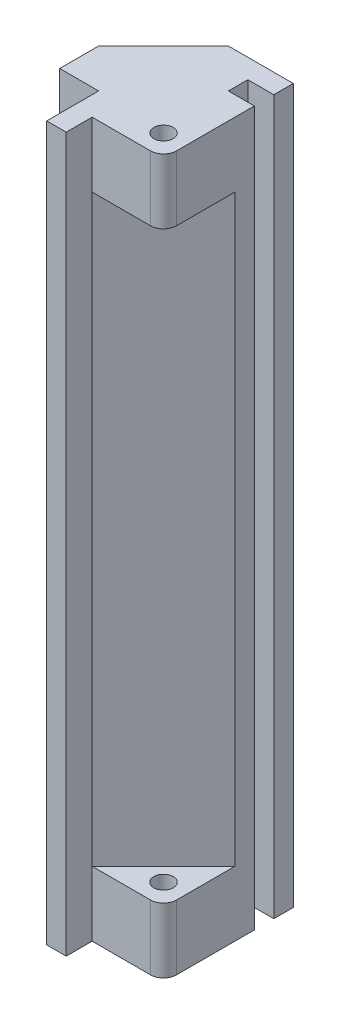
ISO-10303-21;
HEADER;
FILE_DESCRIPTION(('STEP AP214'),'2;1');
FILE_NAME('part.step','',(''),(''),'','','');
FILE_SCHEMA(('AUTOMOTIVE_DESIGN { 1 0 10303 214 1 1 1 1 }'));
ENDSEC;
DATA;
#1=APPLICATION_CONTEXT('core data for automotive mechanical design processes');
#2=APPLICATION_PROTOCOL_DEFINITION('international standard','automotive_design',2000,#1);
#3=PRODUCT_CONTEXT('',#1,'mechanical');
#4=PRODUCT('Part','Part','',(#3));
#5=PRODUCT_RELATED_PRODUCT_CATEGORY('part','',(#4));
#6=PRODUCT_DEFINITION_FORMATION('','',#4);
#7=PRODUCT_DEFINITION_CONTEXT('part definition',#1,'design');
#8=PRODUCT_DEFINITION('design','',#6,#7);
#9=PRODUCT_DEFINITION_SHAPE('','',#8);
#10=(LENGTH_UNIT() NAMED_UNIT(*) SI_UNIT(.MILLI.,.METRE.));
#11=(NAMED_UNIT(*) PLANE_ANGLE_UNIT() SI_UNIT($,.RADIAN.));
#12=(NAMED_UNIT(*) SI_UNIT($,.STERADIAN.) SOLID_ANGLE_UNIT());
#13=UNCERTAINTY_MEASURE_WITH_UNIT(LENGTH_MEASURE(1.E-05),#10,'distance_accuracy_value','');
#14=(GEOMETRIC_REPRESENTATION_CONTEXT(3) GLOBAL_UNCERTAINTY_ASSIGNED_CONTEXT((#13)) GLOBAL_UNIT_ASSIGNED_CONTEXT((#10,
#11,#12)) REPRESENTATION_CONTEXT('',''));
#15=CARTESIAN_POINT('',(0.,0.,0.));
#16=DIRECTION('',(0.,0.,1.));
#17=DIRECTION('',(1.,0.,0.));
#18=AXIS2_PLACEMENT_3D('',#15,#16,#17);
#19=CARTESIAN_POINT('',(15.,110.,-17.));
#20=DIRECTION('',(0.,0.,-1.));
#21=DIRECTION('',(-1.,0.,0.));
#22=AXIS2_PLACEMENT_3D('',#19,#20,#21);
#23=PLANE('',#22);
#24=DIRECTION('',(1.,0.,0.));
#25=VECTOR('',#24,1.);
#26=CARTESIAN_POINT('',(15.,0.,-17.));
#27=LINE('',#26,#25);
#28=CARTESIAN_POINT('',(11.,0.,-17.));
#29=VERTEX_POINT('',#28);
#30=CARTESIAN_POINT('',(15.,0.,-17.));
#31=VERTEX_POINT('',#30);
#32=EDGE_CURVE('E227',#29,#31,#27,.T.);
#33=ORIENTED_EDGE('',*,*,#32,.T.);
#34=DIRECTION('',(0.,-1.,0.));
#35=VECTOR('',#34,1.);
#36=CARTESIAN_POINT('',(15.,110.,-17.));
#37=LINE('',#36,#35);
#38=CARTESIAN_POINT('',(15.,110.,-17.));
#39=VERTEX_POINT('',#38);
#40=EDGE_CURVE('E292',#39,#31,#37,.T.);
#41=ORIENTED_EDGE('',*,*,#40,.F.);
#42=DIRECTION('',(1.,0.,0.));
#43=VECTOR('',#42,1.);
#44=CARTESIAN_POINT('',(15.,110.,-17.));
#45=LINE('',#44,#43);
#46=CARTESIAN_POINT('',(11.,110.,-17.));
#47=VERTEX_POINT('',#46);
#48=EDGE_CURVE('E228',#47,#39,#45,.T.);
#49=ORIENTED_EDGE('',*,*,#48,.F.);
#50=DIRECTION('',(0.,-1.,0.));
#51=VECTOR('',#50,1.);
#52=CARTESIAN_POINT('',(11.,110.,-17.));
#53=LINE('',#52,#51);
#54=EDGE_CURVE('E251',#47,#29,#53,.T.);
#55=ORIENTED_EDGE('',*,*,#54,.T.);
#56=EDGE_LOOP('',(#33,#41,#49,#55));
#57=FACE_BOUND('',#56,.T.);
#58=ADVANCED_FACE('F33',(#57),#23,.F.);
#59=CARTESIAN_POINT('',(15.,110.,-20.));
#60=DIRECTION('',(-1.,0.,0.));
#61=DIRECTION('',(0.,0.,1.));
#62=AXIS2_PLACEMENT_3D('',#59,#60,#61);
#63=PLANE('',#62);
#64=DIRECTION('',(0.,0.,-1.));
#65=VECTOR('',#64,1.);
#66=CARTESIAN_POINT('',(15.,0.,-20.));
#67=LINE('',#66,#65);
#68=CARTESIAN_POINT('',(15.,0.,-20.));
#69=VERTEX_POINT('',#68);
#70=EDGE_CURVE('E254',#31,#69,#67,.T.);
#71=ORIENTED_EDGE('',*,*,#70,.T.);
#72=DIRECTION('',(0.,-1.,0.));
#73=VECTOR('',#72,1.);
#74=CARTESIAN_POINT('',(15.,110.,-20.));
#75=LINE('',#74,#73);
#76=CARTESIAN_POINT('',(15.,110.,-20.));
#77=VERTEX_POINT('',#76);
#78=EDGE_CURVE('E289',#77,#69,#75,.T.);
#79=ORIENTED_EDGE('',*,*,#78,.F.);
#80=DIRECTION('',(0.,0.,-1.));
#81=VECTOR('',#80,1.);
#82=CARTESIAN_POINT('',(15.,110.,-20.));
#83=LINE('',#82,#81);
#84=EDGE_CURVE('E231',#39,#77,#83,.T.);
#85=ORIENTED_EDGE('',*,*,#84,.F.);
#86=ORIENTED_EDGE('',*,*,#40,.T.);
#87=EDGE_LOOP('',(#71,#79,#85,#86));
#88=FACE_BOUND('',#87,.T.);
#89=ADVANCED_FACE('F323',(#88),#63,.F.);
#90=CARTESIAN_POINT('',(5.,110.,-20.));
#91=DIRECTION('',(0.,0.,1.));
#92=DIRECTION('',(1.,0.,0.));
#93=AXIS2_PLACEMENT_3D('',#90,#91,#92);
#94=PLANE('',#93);
#95=DIRECTION('',(-1.,0.,0.));
#96=VECTOR('',#95,1.);
#97=CARTESIAN_POINT('',(5.,0.,-20.));
#98=LINE('',#97,#96);
#99=CARTESIAN_POINT('',(5.,0.,-20.));
#100=VERTEX_POINT('',#99);
#101=EDGE_CURVE('E256',#69,#100,#98,.T.);
#102=ORIENTED_EDGE('',*,*,#101,.T.);
#103=DIRECTION('',(0.,-1.,0.));
#104=VECTOR('',#103,1.);
#105=CARTESIAN_POINT('',(5.,110.,-20.));
#106=LINE('',#105,#104);
#107=CARTESIAN_POINT('',(5.,110.,-20.));
#108=VERTEX_POINT('',#107);
#109=EDGE_CURVE('E286',#108,#100,#106,.T.);
#110=ORIENTED_EDGE('',*,*,#109,.F.);
#111=DIRECTION('',(-1.,0.,0.));
#112=VECTOR('',#111,1.);
#113=CARTESIAN_POINT('',(5.,110.,-20.));
#114=LINE('',#113,#112);
#115=EDGE_CURVE('E234',#77,#108,#114,.T.);
#116=ORIENTED_EDGE('',*,*,#115,.F.);
#117=ORIENTED_EDGE('',*,*,#78,.T.);
#118=EDGE_LOOP('',(#102,#110,#116,#117));
#119=FACE_BOUND('',#118,.T.);
#120=ADVANCED_FACE('F329',(#119),#94,.F.);
#121=CARTESIAN_POINT('',(-5.,110.,-10.));
#122=DIRECTION('',(0.707106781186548,0.,0.707106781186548));
#123=DIRECTION('',(0.707106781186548,0.,-0.707106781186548));
#124=AXIS2_PLACEMENT_3D('',#121,#122,#123);
#125=PLANE('',#124);
#126=DIRECTION('',(-0.707106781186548,0.,0.707106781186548));
#127=VECTOR('',#126,1.);
#128=CARTESIAN_POINT('',(-5.,0.,-10.));
#129=LINE('',#128,#127);
#130=CARTESIAN_POINT('',(-5.,0.,-10.));
#131=VERTEX_POINT('',#130);
#132=EDGE_CURVE('E258',#100,#131,#129,.T.);
#133=ORIENTED_EDGE('',*,*,#132,.T.);
#134=DIRECTION('',(0.,-1.,0.));
#135=VECTOR('',#134,1.);
#136=CARTESIAN_POINT('',(-5.,110.,-10.));
#137=LINE('',#136,#135);
#138=CARTESIAN_POINT('',(-5.,110.,-10.));
#139=VERTEX_POINT('',#138);
#140=EDGE_CURVE('E283',#139,#131,#137,.T.);
#141=ORIENTED_EDGE('',*,*,#140,.F.);
#142=DIRECTION('',(-0.707106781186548,0.,0.707106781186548));
#143=VECTOR('',#142,1.);
#144=CARTESIAN_POINT('',(-5.,110.,-10.));
#145=LINE('',#144,#143);
#146=EDGE_CURVE('E236',#108,#139,#145,.T.);
#147=ORIENTED_EDGE('',*,*,#146,.F.);
#148=ORIENTED_EDGE('',*,*,#109,.T.);
#149=EDGE_LOOP('',(#133,#141,#147,#148));
#150=FACE_BOUND('',#149,.T.);
#151=ADVANCED_FACE('F335',(#150),#125,.F.);
#152=CARTESIAN_POINT('',(-5.,110.,-10.));
#153=DIRECTION('',(1.,0.,0.));
#154=DIRECTION('',(0.,0.,-1.));
#155=AXIS2_PLACEMENT_3D('',#152,#153,#154);
#156=PLANE('',#155);
#157=DIRECTION('',(0.,0.,1.));
#158=VECTOR('',#157,1.);
#159=CARTESIAN_POINT('',(-5.,0.,-10.));
#160=LINE('',#159,#158);
#161=CARTESIAN_POINT('',(-5.,0.,-4.));
#162=VERTEX_POINT('',#161);
#163=EDGE_CURVE('E260',#131,#162,#160,.T.);
#164=ORIENTED_EDGE('',*,*,#163,.T.);
#165=DIRECTION('',(0.,1.,0.));
#166=VECTOR('',#165,1.);
#167=CARTESIAN_POINT('',(-5.,110.,-4.));
#168=LINE('',#167,#166);
#169=CARTESIAN_POINT('',(-5.,110.,-4.));
#170=VERTEX_POINT('',#169);
#171=EDGE_CURVE('E224',#162,#170,#168,.T.);
#172=ORIENTED_EDGE('',*,*,#171,.T.);
#173=DIRECTION('',(0.,0.,1.));
#174=VECTOR('',#173,1.);
#175=CARTESIAN_POINT('',(-5.,110.,-10.));
#176=LINE('',#175,#174);
#177=EDGE_CURVE('E238',#139,#170,#176,.T.);
#178=ORIENTED_EDGE('',*,*,#177,.F.);
#179=ORIENTED_EDGE('',*,*,#140,.T.);
#180=EDGE_LOOP('',(#164,#172,#178,#179));
#181=FACE_BOUND('',#180,.T.);
#182=ADVANCED_FACE('F339',(#181),#156,.F.);
#183=CARTESIAN_POINT('',(-2.,110.,-4.));
#184=DIRECTION('',(0.,0.,-1.));
#185=DIRECTION('',(-1.,0.,0.));
#186=AXIS2_PLACEMENT_3D('',#183,#184,#185);
#187=PLANE('',#186);
#188=DIRECTION('',(1.,0.,0.));
#189=VECTOR('',#188,1.);
#190=CARTESIAN_POINT('',(-2.,0.,-4.));
#191=LINE('',#190,#189);
#192=CARTESIAN_POINT('',(1.,0.,-4.));
#193=VERTEX_POINT('',#192);
#194=EDGE_CURVE('E263',#162,#193,#191,.T.);
#195=ORIENTED_EDGE('',*,*,#194,.T.);
#196=DIRECTION('',(0.,-1.,0.));
#197=VECTOR('',#196,1.);
#198=CARTESIAN_POINT('',(1.,110.,-4.));
#199=LINE('',#198,#197);
#200=CARTESIAN_POINT('',(1.,110.,-4.));
#201=VERTEX_POINT('',#200);
#202=EDGE_CURVE('E184',#201,#193,#199,.T.);
#203=ORIENTED_EDGE('',*,*,#202,.F.);
#204=DIRECTION('',(1.,0.,0.));
#205=VECTOR('',#204,1.);
#206=CARTESIAN_POINT('',(-2.,110.,-4.));
#207=LINE('',#206,#205);
#208=EDGE_CURVE('E241',#170,#201,#207,.T.);
#209=ORIENTED_EDGE('',*,*,#208,.F.);
#210=ORIENTED_EDGE('',*,*,#171,.F.);
#211=EDGE_LOOP('',(#195,#203,#209,#210));
#212=FACE_BOUND('',#211,.T.);
#213=ADVANCED_FACE('F343',(#212),#187,.F.);
#214=CARTESIAN_POINT('',(1.,110.,-4.));
#215=DIRECTION('',(1.,0.,0.));
#216=DIRECTION('',(0.,0.,-1.));
#217=AXIS2_PLACEMENT_3D('',#214,#215,#216);
#218=PLANE('',#217);
#219=DIRECTION('',(0.,0.,1.));
#220=VECTOR('',#219,1.);
#221=CARTESIAN_POINT('',(1.,0.,-4.));
#222=LINE('',#221,#220);
#223=CARTESIAN_POINT('',(1.,0.,4.));
#224=VERTEX_POINT('',#223);
#225=EDGE_CURVE('E265',#193,#224,#222,.T.);
#226=ORIENTED_EDGE('',*,*,#225,.T.);
#227=DIRECTION('',(0.,-1.,0.));
#228=VECTOR('',#227,1.);
#229=CARTESIAN_POINT('',(1.,110.,4.));
#230=LINE('',#229,#228);
#231=CARTESIAN_POINT('',(1.,110.,4.));
#232=VERTEX_POINT('',#231);
#233=EDGE_CURVE('E217',#232,#224,#230,.T.);
#234=ORIENTED_EDGE('',*,*,#233,.F.);
#235=DIRECTION('',(0.,0.,1.));
#236=VECTOR('',#235,1.);
#237=CARTESIAN_POINT('',(1.,110.,-4.));
#238=LINE('',#237,#236);
#239=EDGE_CURVE('E243',#201,#232,#238,.T.);
#240=ORIENTED_EDGE('',*,*,#239,.F.);
#241=ORIENTED_EDGE('',*,*,#202,.T.);
#242=EDGE_LOOP('',(#226,#234,#240,#241));
#243=FACE_BOUND('',#242,.T.);
#244=ADVANCED_FACE('F347',(#243),#218,.F.);
#245=CARTESIAN_POINT('',(15.,110.,-11.));
#246=DIRECTION('',(-0.707106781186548,0.,-0.707106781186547));
#247=DIRECTION('',(-0.707106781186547,0.,0.707106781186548));
#248=AXIS2_PLACEMENT_3D('',#245,#246,#247);
#249=PLANE('',#248);
#250=DIRECTION('',(0.,-1.,0.));
#251=VECTOR('',#250,1.);
#252=CARTESIAN_POINT('',(15.,110.,-11.));
#253=LINE('',#252,#251);
#254=CARTESIAN_POINT('',(15.,100.,-11.));
#255=VERTEX_POINT('',#254);
#256=CARTESIAN_POINT('',(15.,9.99999999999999,-11.));
#257=VERTEX_POINT('',#256);
#258=EDGE_CURVE('E171',#255,#257,#253,.T.);
#259=ORIENTED_EDGE('',*,*,#258,.F.);
#260=DIRECTION('',(-0.707106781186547,0.,0.707106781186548));
#261=VECTOR('',#260,1.);
#262=CARTESIAN_POINT('',(4.,100.,0.));
#263=LINE('',#262,#261);
#264=CARTESIAN_POINT('',(4.,100.,0.));
#265=VERTEX_POINT('',#264);
#266=EDGE_CURVE('E175',#255,#265,#263,.T.);
#267=ORIENTED_EDGE('',*,*,#266,.T.);
#268=DIRECTION('',(0.,-1.,0.));
#269=VECTOR('',#268,1.);
#270=CARTESIAN_POINT('',(4.,110.,0.));
#271=LINE('',#270,#269);
#272=CARTESIAN_POINT('',(4.,9.99999999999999,0.));
#273=VERTEX_POINT('',#272);
#274=EDGE_CURVE('E158',#265,#273,#271,.T.);
#275=ORIENTED_EDGE('',*,*,#274,.T.);
#276=DIRECTION('',(0.707106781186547,0.,-0.707106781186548));
#277=VECTOR('',#276,1.);
#278=CARTESIAN_POINT('',(15.,10.,-11.));
#279=LINE('',#278,#277);
#280=EDGE_CURVE('E200',#273,#257,#279,.T.);
#281=ORIENTED_EDGE('',*,*,#280,.T.);
#282=EDGE_LOOP('',(#259,#267,#275,#281));
#283=FACE_BOUND('',#282,.T.);
#284=ADVANCED_FACE('F176',(#283),#249,.F.);
#285=CARTESIAN_POINT('',(15.,110.,-14.));
#286=DIRECTION('',(-1.,0.,0.));
#287=DIRECTION('',(0.,0.,1.));
#288=AXIS2_PLACEMENT_3D('',#285,#286,#287);
#289=PLANE('',#288);
#290=DIRECTION('',(0.,0.,1.));
#291=VECTOR('',#290,1.);
#292=CARTESIAN_POINT('',(15.,10.,0.));
#293=LINE('',#292,#291);
#294=CARTESIAN_POINT('',(15.,10.,-2.));
#295=VERTEX_POINT('',#294);
#296=EDGE_CURVE('E202',#257,#295,#293,.T.);
#297=ORIENTED_EDGE('',*,*,#296,.T.);
#298=DIRECTION('',(0.,-1.,0.));
#299=VECTOR('',#298,1.);
#300=CARTESIAN_POINT('',(15.,0.,-2.));
#301=LINE('',#300,#299);
#302=CARTESIAN_POINT('',(15.,0.,-2.));
#303=VERTEX_POINT('',#302);
#304=EDGE_CURVE('E297',#295,#303,#301,.T.);
#305=ORIENTED_EDGE('',*,*,#304,.T.);
#306=DIRECTION('',(0.,0.,-1.));
#307=VECTOR('',#306,1.);
#308=CARTESIAN_POINT('',(15.,0.,-14.));
#309=LINE('',#308,#307);
#310=CARTESIAN_POINT('',(15.,0.,-14.));
#311=VERTEX_POINT('',#310);
#312=EDGE_CURVE('E267',#303,#311,#309,.T.);
#313=ORIENTED_EDGE('',*,*,#312,.T.);
#314=DIRECTION('',(0.,-1.,0.));
#315=VECTOR('',#314,1.);
#316=CARTESIAN_POINT('',(15.,110.,-14.));
#317=LINE('',#316,#315);
#318=CARTESIAN_POINT('',(15.,110.,-14.));
#319=VERTEX_POINT('',#318);
#320=EDGE_CURVE('E277',#319,#311,#317,.T.);
#321=ORIENTED_EDGE('',*,*,#320,.F.);
#322=DIRECTION('',(0.,0.,-1.));
#323=VECTOR('',#322,1.);
#324=CARTESIAN_POINT('',(15.,110.,-14.));
#325=LINE('',#324,#323);
#326=CARTESIAN_POINT('',(15.,110.,-2.));
#327=VERTEX_POINT('',#326);
#328=EDGE_CURVE('E245',#327,#319,#325,.T.);
#329=ORIENTED_EDGE('',*,*,#328,.F.);
#330=DIRECTION('',(0.,1.,0.));
#331=VECTOR('',#330,1.);
#332=CARTESIAN_POINT('',(15.,100.,-2.));
#333=LINE('',#332,#331);
#334=CARTESIAN_POINT('',(15.,100.,-2.));
#335=VERTEX_POINT('',#334);
#336=EDGE_CURVE('E295',#327,#335,#333,.F.);
#337=ORIENTED_EDGE('',*,*,#336,.T.);
#338=DIRECTION('',(0.,0.,-1.));
#339=VECTOR('',#338,1.);
#340=CARTESIAN_POINT('',(15.,100.,-11.));
#341=LINE('',#340,#339);
#342=EDGE_CURVE('E186',#335,#255,#341,.T.);
#343=ORIENTED_EDGE('',*,*,#342,.T.);
#344=ORIENTED_EDGE('',*,*,#258,.T.);
#345=EDGE_LOOP('',(#297,#305,#313,#321,#329,#337,#343,#344));
#346=FACE_BOUND('',#345,.T.);
#347=ADVANCED_FACE('F313',(#346),#289,.F.);
#348=CARTESIAN_POINT('',(11.,110.,-14.));
#349=DIRECTION('',(0.,0.,1.));
#350=DIRECTION('',(1.,0.,0.));
#351=AXIS2_PLACEMENT_3D('',#348,#349,#350);
#352=PLANE('',#351);
#353=DIRECTION('',(-1.,0.,0.));
#354=VECTOR('',#353,1.);
#355=CARTESIAN_POINT('',(11.,0.,-14.));
#356=LINE('',#355,#354);
#357=CARTESIAN_POINT('',(11.,0.,-14.));
#358=VERTEX_POINT('',#357);
#359=EDGE_CURVE('E269',#311,#358,#356,.T.);
#360=ORIENTED_EDGE('',*,*,#359,.T.);
#361=DIRECTION('',(0.,-1.,0.));
#362=VECTOR('',#361,1.);
#363=CARTESIAN_POINT('',(11.,110.,-14.));
#364=LINE('',#363,#362);
#365=CARTESIAN_POINT('',(11.,110.,-14.));
#366=VERTEX_POINT('',#365);
#367=EDGE_CURVE('E274',#366,#358,#364,.T.);
#368=ORIENTED_EDGE('',*,*,#367,.F.);
#369=DIRECTION('',(-1.,0.,0.));
#370=VECTOR('',#369,1.);
#371=CARTESIAN_POINT('',(11.,110.,-14.));
#372=LINE('',#371,#370);
#373=EDGE_CURVE('E247',#319,#366,#372,.T.);
#374=ORIENTED_EDGE('',*,*,#373,.F.);
#375=ORIENTED_EDGE('',*,*,#320,.T.);
#376=EDGE_LOOP('',(#360,#368,#374,#375));
#377=FACE_BOUND('',#376,.T.);
#378=ADVANCED_FACE('F356',(#377),#352,.F.);
#379=CARTESIAN_POINT('',(11.,110.,-17.));
#380=DIRECTION('',(-1.,0.,0.));
#381=DIRECTION('',(0.,0.,1.));
#382=AXIS2_PLACEMENT_3D('',#379,#380,#381);
#383=PLANE('',#382);
#384=DIRECTION('',(0.,0.,-1.));
#385=VECTOR('',#384,1.);
#386=CARTESIAN_POINT('',(11.,0.,-17.));
#387=LINE('',#386,#385);
#388=EDGE_CURVE('E232',#358,#29,#387,.T.);
#389=ORIENTED_EDGE('',*,*,#388,.T.);
#390=ORIENTED_EDGE('',*,*,#54,.F.);
#391=DIRECTION('',(0.,0.,-1.));
#392=VECTOR('',#391,1.);
#393=CARTESIAN_POINT('',(11.,110.,-17.));
#394=LINE('',#393,#392);
#395=EDGE_CURVE('E249',#366,#47,#394,.T.);
#396=ORIENTED_EDGE('',*,*,#395,.F.);
#397=ORIENTED_EDGE('',*,*,#367,.T.);
#398=EDGE_LOOP('',(#389,#390,#396,#397));
#399=FACE_BOUND('',#398,.T.);
#400=ADVANCED_FACE('F359',(#399),#383,.F.);
#401=CARTESIAN_POINT('',(0.,110.,0.));
#402=DIRECTION('',(0.,1.,0.));
#403=DIRECTION('',(0.,0.,1.));
#404=AXIS2_PLACEMENT_3D('',#401,#402,#403);
#405=PLANE('',#404);
#406=DIRECTION('',(1.,0.,0.));
#407=VECTOR('',#406,1.);
#408=CARTESIAN_POINT('',(15.,110.,0.));
#409=LINE('',#408,#407);
#410=CARTESIAN_POINT('',(4.,110.,0.));
#411=VERTEX_POINT('',#410);
#412=CARTESIAN_POINT('',(13.,110.,0.));
#413=VERTEX_POINT('',#412);
#414=EDGE_CURVE('E178',#411,#413,#409,.T.);
#415=ORIENTED_EDGE('',*,*,#414,.T.);
#416=CARTESIAN_POINT('',(13.,110.,-2.));
#417=DIRECTION('',(0.,1.,0.));
#418=DIRECTION('',(0.,0.,1.));
#419=AXIS2_PLACEMENT_3D('',#416,#417,#418);
#420=CIRCLE('',#419,2.);
#421=EDGE_CURVE('E41',#413,#327,#420,.T.);
#422=ORIENTED_EDGE('',*,*,#421,.T.);
#423=ORIENTED_EDGE('',*,*,#328,.T.);
#424=ORIENTED_EDGE('',*,*,#373,.T.);
#425=ORIENTED_EDGE('',*,*,#395,.T.);
#426=ORIENTED_EDGE('',*,*,#48,.T.);
#427=ORIENTED_EDGE('',*,*,#84,.T.);
#428=ORIENTED_EDGE('',*,*,#115,.T.);
#429=ORIENTED_EDGE('',*,*,#146,.T.);
#430=ORIENTED_EDGE('',*,*,#177,.T.);
#431=ORIENTED_EDGE('',*,*,#208,.T.);
#432=ORIENTED_EDGE('',*,*,#239,.T.);
#433=DIRECTION('',(-1.,0.,0.));
#434=VECTOR('',#433,1.);
#435=CARTESIAN_POINT('',(4.,110.,4.));
#436=LINE('',#435,#434);
#437=CARTESIAN_POINT('',(4.,110.,4.));
#438=VERTEX_POINT('',#437);
#439=EDGE_CURVE('E214',#438,#232,#436,.T.);
#440=ORIENTED_EDGE('',*,*,#439,.F.);
#441=DIRECTION('',(0.,0.,-1.));
#442=VECTOR('',#441,1.);
#443=CARTESIAN_POINT('',(4.,110.,4.));
#444=LINE('',#443,#442);
#445=EDGE_CURVE('E220',#438,#411,#444,.T.);
#446=ORIENTED_EDGE('',*,*,#445,.T.);
#447=EDGE_LOOP('',(#415,#422,#423,#424,#425,#426,#427,#428,#429,#430,#431,#432,#440,#446));
#448=FACE_BOUND('',#447,.T.);
#449=CARTESIAN_POINT('',(11.6213203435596,110.,-3.37867965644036));
#450=DIRECTION('',(0.,1.,0.));
#451=DIRECTION('',(0.,0.,1.));
#452=AXIS2_PLACEMENT_3D('',#449,#450,#451);
#453=CIRCLE('',#452,1.5);
#454=CARTESIAN_POINT('',(11.6213203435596,110.,-1.87867965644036));
#455=VERTEX_POINT('',#454);
#456=EDGE_CURVE('E402',#455,#455,#453,.T.);
#457=ORIENTED_EDGE('',*,*,#456,.F.);
#458=EDGE_LOOP('',(#457));
#459=FACE_BOUND('',#458,.T.);
#460=ADVANCED_FACE('F309',(#448,#459),#405,.T.);
#461=CARTESIAN_POINT('',(0.,0.,0.));
#462=DIRECTION('',(0.,1.,0.));
#463=DIRECTION('',(0.,0.,1.));
#464=AXIS2_PLACEMENT_3D('',#461,#462,#463);
#465=PLANE('',#464);
#466=ORIENTED_EDGE('',*,*,#312,.F.);
#467=CARTESIAN_POINT('',(13.,0.,-2.));
#468=DIRECTION('',(0.,1.,0.));
#469=DIRECTION('',(0.,0.,1.));
#470=AXIS2_PLACEMENT_3D('',#467,#468,#469);
#471=CIRCLE('',#470,2.);
#472=CARTESIAN_POINT('',(13.,0.,0.));
#473=VERTEX_POINT('',#472);
#474=EDGE_CURVE('E300',#303,#473,#471,.F.);
#475=ORIENTED_EDGE('',*,*,#474,.T.);
#476=DIRECTION('',(-1.,0.,0.));
#477=VECTOR('',#476,1.);
#478=CARTESIAN_POINT('',(4.,0.,0.));
#479=LINE('',#478,#477);
#480=CARTESIAN_POINT('',(4.,0.,0.));
#481=VERTEX_POINT('',#480);
#482=EDGE_CURVE('E197',#473,#481,#479,.T.);
#483=ORIENTED_EDGE('',*,*,#482,.T.);
#484=DIRECTION('',(0.,0.,-1.));
#485=VECTOR('',#484,1.);
#486=CARTESIAN_POINT('',(4.,0.,4.));
#487=LINE('',#486,#485);
#488=CARTESIAN_POINT('',(4.,0.,4.));
#489=VERTEX_POINT('',#488);
#490=EDGE_CURVE('E222',#489,#481,#487,.T.);
#491=ORIENTED_EDGE('',*,*,#490,.F.);
#492=DIRECTION('',(1.,0.,0.));
#493=VECTOR('',#492,1.);
#494=CARTESIAN_POINT('',(1.,0.,4.));
#495=LINE('',#494,#493);
#496=EDGE_CURVE('E209',#224,#489,#495,.T.);
#497=ORIENTED_EDGE('',*,*,#496,.F.);
#498=ORIENTED_EDGE('',*,*,#225,.F.);
#499=ORIENTED_EDGE('',*,*,#194,.F.);
#500=ORIENTED_EDGE('',*,*,#163,.F.);
#501=ORIENTED_EDGE('',*,*,#132,.F.);
#502=ORIENTED_EDGE('',*,*,#101,.F.);
#503=ORIENTED_EDGE('',*,*,#70,.F.);
#504=ORIENTED_EDGE('',*,*,#32,.F.);
#505=ORIENTED_EDGE('',*,*,#388,.F.);
#506=ORIENTED_EDGE('',*,*,#359,.F.);
#507=EDGE_LOOP('',(#466,#475,#483,#491,#497,#498,#499,#500,#501,#502,#503,#504,#505,#506));
#508=FACE_BOUND('',#507,.T.);
#509=CARTESIAN_POINT('',(11.6213203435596,0.,-3.37867965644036));
#510=DIRECTION('',(0.,-1.,0.));
#511=DIRECTION('',(0.,0.,-1.));
#512=AXIS2_PLACEMENT_3D('',#509,#510,#511);
#513=CIRCLE('',#512,1.5);
#514=CARTESIAN_POINT('',(11.6213203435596,0.,-4.87867965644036));
#515=VERTEX_POINT('',#514);
#516=EDGE_CURVE('E188',#515,#515,#513,.T.);
#517=ORIENTED_EDGE('',*,*,#516,.F.);
#518=EDGE_LOOP('',(#517));
#519=FACE_BOUND('',#518,.T.);
#520=ADVANCED_FACE('F364',(#508,#519),#465,.F.);
#521=CARTESIAN_POINT('',(4.,0.,4.));
#522=DIRECTION('',(-1.,0.,0.));
#523=DIRECTION('',(0.,0.,1.));
#524=AXIS2_PLACEMENT_3D('',#521,#522,#523);
#525=PLANE('',#524);
#526=EDGE_CURVE('E163',#411,#265,#271,.T.);
#527=ORIENTED_EDGE('',*,*,#526,.F.);
#528=ORIENTED_EDGE('',*,*,#445,.F.);
#529=DIRECTION('',(0.,1.,0.));
#530=VECTOR('',#529,1.);
#531=CARTESIAN_POINT('',(4.,0.,4.));
#532=LINE('',#531,#530);
#533=EDGE_CURVE('E212',#489,#438,#532,.T.);
#534=ORIENTED_EDGE('',*,*,#533,.F.);
#535=ORIENTED_EDGE('',*,*,#490,.T.);
#536=DIRECTION('',(0.,-1.,0.));
#537=VECTOR('',#536,1.);
#538=CARTESIAN_POINT('',(4.,10.,0.));
#539=LINE('',#538,#537);
#540=EDGE_CURVE('E167',#273,#481,#539,.T.);
#541=ORIENTED_EDGE('',*,*,#540,.F.);
#542=ORIENTED_EDGE('',*,*,#274,.F.);
#543=EDGE_LOOP('',(#527,#528,#534,#535,#541,#542));
#544=FACE_BOUND('',#543,.T.);
#545=ADVANCED_FACE('F160',(#544),#525,.F.);
#546=CARTESIAN_POINT('',(0.,0.,4.));
#547=DIRECTION('',(0.,0.,1.));
#548=DIRECTION('',(1.,0.,0.));
#549=AXIS2_PLACEMENT_3D('',#546,#547,#548);
#550=PLANE('',#549);
#551=ORIENTED_EDGE('',*,*,#496,.T.);
#552=ORIENTED_EDGE('',*,*,#533,.T.);
#553=ORIENTED_EDGE('',*,*,#439,.T.);
#554=ORIENTED_EDGE('',*,*,#233,.T.);
#555=EDGE_LOOP('',(#551,#552,#553,#554));
#556=FACE_BOUND('',#555,.T.);
#557=ADVANCED_FACE('F372',(#556),#550,.T.);
#558=CARTESIAN_POINT('',(4.,10.,0.));
#559=DIRECTION('',(0.,0.,1.));
#560=DIRECTION('',(1.,0.,0.));
#561=AXIS2_PLACEMENT_3D('',#558,#559,#560);
#562=PLANE('',#561);
#563=ORIENTED_EDGE('',*,*,#482,.F.);
#564=DIRECTION('',(0.,-1.,0.));
#565=VECTOR('',#564,1.);
#566=CARTESIAN_POINT('',(13.,9.99999999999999,0.));
#567=LINE('',#566,#565);
#568=CARTESIAN_POINT('',(13.,10.,0.));
#569=VERTEX_POINT('',#568);
#570=EDGE_CURVE('E302',#473,#569,#567,.F.);
#571=ORIENTED_EDGE('',*,*,#570,.T.);
#572=DIRECTION('',(-1.,0.,0.));
#573=VECTOR('',#572,1.);
#574=CARTESIAN_POINT('',(4.,10.,0.));
#575=LINE('',#574,#573);
#576=EDGE_CURVE('E205',#569,#273,#575,.T.);
#577=ORIENTED_EDGE('',*,*,#576,.T.);
#578=ORIENTED_EDGE('',*,*,#540,.T.);
#579=EDGE_LOOP('',(#563,#571,#577,#578));
#580=FACE_BOUND('',#579,.T.);
#581=ADVANCED_FACE('F375',(#580),#562,.T.);
#582=CARTESIAN_POINT('',(0.,10.,0.));
#583=DIRECTION('',(0.,1.,0.));
#584=DIRECTION('',(0.,0.,1.));
#585=AXIS2_PLACEMENT_3D('',#582,#583,#584);
#586=PLANE('',#585);
#587=CARTESIAN_POINT('',(11.6213203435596,10.,-3.37867965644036));
#588=DIRECTION('',(0.,-1.,0.));
#589=DIRECTION('',(0.,0.,-1.));
#590=AXIS2_PLACEMENT_3D('',#587,#588,#589);
#591=CIRCLE('',#590,1.5);
#592=CARTESIAN_POINT('',(11.6213203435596,10.,-4.87867965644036));
#593=VERTEX_POINT('',#592);
#594=EDGE_CURVE('E194',#593,#593,#591,.T.);
#595=ORIENTED_EDGE('',*,*,#594,.T.);
#596=EDGE_LOOP('',(#595));
#597=FACE_BOUND('',#596,.T.);
#598=ORIENTED_EDGE('',*,*,#576,.F.);
#599=CARTESIAN_POINT('',(13.,9.99999999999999,-2.));
#600=DIRECTION('',(0.,1.,0.));
#601=DIRECTION('',(0.,0.,1.));
#602=AXIS2_PLACEMENT_3D('',#599,#600,#601);
#603=CIRCLE('',#602,2.);
#604=EDGE_CURVE('E304',#569,#295,#603,.T.);
#605=ORIENTED_EDGE('',*,*,#604,.T.);
#606=ORIENTED_EDGE('',*,*,#296,.F.);
#607=ORIENTED_EDGE('',*,*,#280,.F.);
#608=EDGE_LOOP('',(#598,#605,#606,#607));
#609=FACE_BOUND('',#608,.T.);
#610=ADVANCED_FACE('F379',(#597,#609),#586,.T.);
#611=CARTESIAN_POINT('',(11.6213203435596,10.,-3.37867965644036));
#612=DIRECTION('',(0.,-1.,0.));
#613=DIRECTION('',(0.,0.,-1.));
#614=AXIS2_PLACEMENT_3D('',#611,#612,#613);
#615=CYLINDRICAL_SURFACE('',#614,1.5);
#616=ORIENTED_EDGE('',*,*,#594,.F.);
#617=EDGE_LOOP('',(#616));
#618=FACE_BOUND('',#617,.T.);
#619=ORIENTED_EDGE('',*,*,#516,.T.);
#620=EDGE_LOOP('',(#619));
#621=FACE_BOUND('',#620,.T.);
#622=ADVANCED_FACE('F383',(#618,#621),#615,.F.);
#623=CARTESIAN_POINT('',(15.,100.,0.));
#624=DIRECTION('',(0.,0.,1.));
#625=DIRECTION('',(1.,0.,0.));
#626=AXIS2_PLACEMENT_3D('',#623,#624,#625);
#627=PLANE('',#626);
#628=DIRECTION('',(1.,0.,0.));
#629=VECTOR('',#628,1.);
#630=CARTESIAN_POINT('',(15.,100.,0.));
#631=LINE('',#630,#629);
#632=CARTESIAN_POINT('',(13.,100.,0.));
#633=VERTEX_POINT('',#632);
#634=EDGE_CURVE('E177',#265,#633,#631,.T.);
#635=ORIENTED_EDGE('',*,*,#634,.T.);
#636=DIRECTION('',(0.,1.,0.));
#637=VECTOR('',#636,1.);
#638=CARTESIAN_POINT('',(13.,110.,0.));
#639=LINE('',#638,#637);
#640=EDGE_CURVE('E306',#633,#413,#639,.T.);
#641=ORIENTED_EDGE('',*,*,#640,.T.);
#642=ORIENTED_EDGE('',*,*,#414,.F.);
#643=ORIENTED_EDGE('',*,*,#526,.T.);
#644=EDGE_LOOP('',(#635,#641,#642,#643));
#645=FACE_BOUND('',#644,.T.);
#646=ADVANCED_FACE('F182',(#645),#627,.T.);
#647=CARTESIAN_POINT('',(0.,100.,0.));
#648=DIRECTION('',(0.,-1.,0.));
#649=DIRECTION('',(0.,0.,-1.));
#650=AXIS2_PLACEMENT_3D('',#647,#648,#649);
#651=PLANE('',#650);
#652=CARTESIAN_POINT('',(11.6213203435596,100.,-3.37867965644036));
#653=DIRECTION('',(0.,1.,0.));
#654=DIRECTION('',(0.,0.,1.));
#655=AXIS2_PLACEMENT_3D('',#652,#653,#654);
#656=CIRCLE('',#655,1.5);
#657=CARTESIAN_POINT('',(11.6213203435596,100.,-1.87867965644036));
#658=VERTEX_POINT('',#657);
#659=EDGE_CURVE('E193',#658,#658,#656,.T.);
#660=ORIENTED_EDGE('',*,*,#659,.T.);
#661=EDGE_LOOP('',(#660));
#662=FACE_BOUND('',#661,.T.);
#663=ORIENTED_EDGE('',*,*,#342,.F.);
#664=CARTESIAN_POINT('',(13.,100.,-2.));
#665=DIRECTION('',(0.,-1.,0.));
#666=DIRECTION('',(0.,0.,-1.));
#667=AXIS2_PLACEMENT_3D('',#664,#665,#666);
#668=CIRCLE('',#667,2.);
#669=EDGE_CURVE('E11',#335,#633,#668,.T.);
#670=ORIENTED_EDGE('',*,*,#669,.T.);
#671=ORIENTED_EDGE('',*,*,#634,.F.);
#672=ORIENTED_EDGE('',*,*,#266,.F.);
#673=EDGE_LOOP('',(#663,#670,#671,#672));
#674=FACE_BOUND('',#673,.T.);
#675=ADVANCED_FACE('F185',(#662,#674),#651,.T.);
#676=CARTESIAN_POINT('',(11.6213203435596,100.,-3.37867965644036));
#677=DIRECTION('',(0.,1.,0.));
#678=DIRECTION('',(0.,0.,1.));
#679=AXIS2_PLACEMENT_3D('',#676,#677,#678);
#680=CYLINDRICAL_SURFACE('',#679,1.5);
#681=ORIENTED_EDGE('',*,*,#659,.F.);
#682=EDGE_LOOP('',(#681));
#683=FACE_BOUND('',#682,.T.);
#684=ORIENTED_EDGE('',*,*,#456,.T.);
#685=EDGE_LOOP('',(#684));
#686=FACE_BOUND('',#685,.T.);
#687=ADVANCED_FACE('F320',(#683,#686),#680,.F.);
#688=CARTESIAN_POINT('',(13.,110.,-2.));
#689=DIRECTION('',(0.,1.,0.));
#690=DIRECTION('',(0.,0.,1.));
#691=AXIS2_PLACEMENT_3D('',#688,#689,#690);
#692=CYLINDRICAL_SURFACE('',#691,2.);
#693=ORIENTED_EDGE('',*,*,#604,.F.);
#694=ORIENTED_EDGE('',*,*,#570,.F.);
#695=ORIENTED_EDGE('',*,*,#474,.F.);
#696=ORIENTED_EDGE('',*,*,#304,.F.);
#697=EDGE_LOOP('',(#693,#694,#695,#696));
#698=FACE_BOUND('',#697,.T.);
#699=ADVANCED_FACE('F316',(#698),#692,.T.);
#700=CARTESIAN_POINT('',(13.,100.,-2.));
#701=DIRECTION('',(0.,-1.,0.));
#702=DIRECTION('',(0.,0.,-1.));
#703=AXIS2_PLACEMENT_3D('',#700,#701,#702);
#704=CYLINDRICAL_SURFACE('',#703,2.);
#705=ORIENTED_EDGE('',*,*,#669,.F.);
#706=ORIENTED_EDGE('',*,*,#336,.F.);
#707=ORIENTED_EDGE('',*,*,#421,.F.);
#708=ORIENTED_EDGE('',*,*,#640,.F.);
#709=EDGE_LOOP('',(#705,#706,#707,#708));
#710=FACE_BOUND('',#709,.T.);
#711=ADVANCED_FACE('F35',(#710),#704,.T.);
#712=CLOSED_SHELL('',(#58,#89,#120,#151,#182,#213,#244,#284,#347,#378,#400,#460,#520,#545,#557,
#581,#610,#622,#646,#675,#687,#699,#711));
#713=MANIFOLD_SOLID_BREP('B2',#712);
#714=ADVANCED_BREP_SHAPE_REPRESENTATION('',(#18,#713),#14);
#715=SHAPE_DEFINITION_REPRESENTATION(#9,#714);
ENDSEC;
END-ISO-10303-21;
